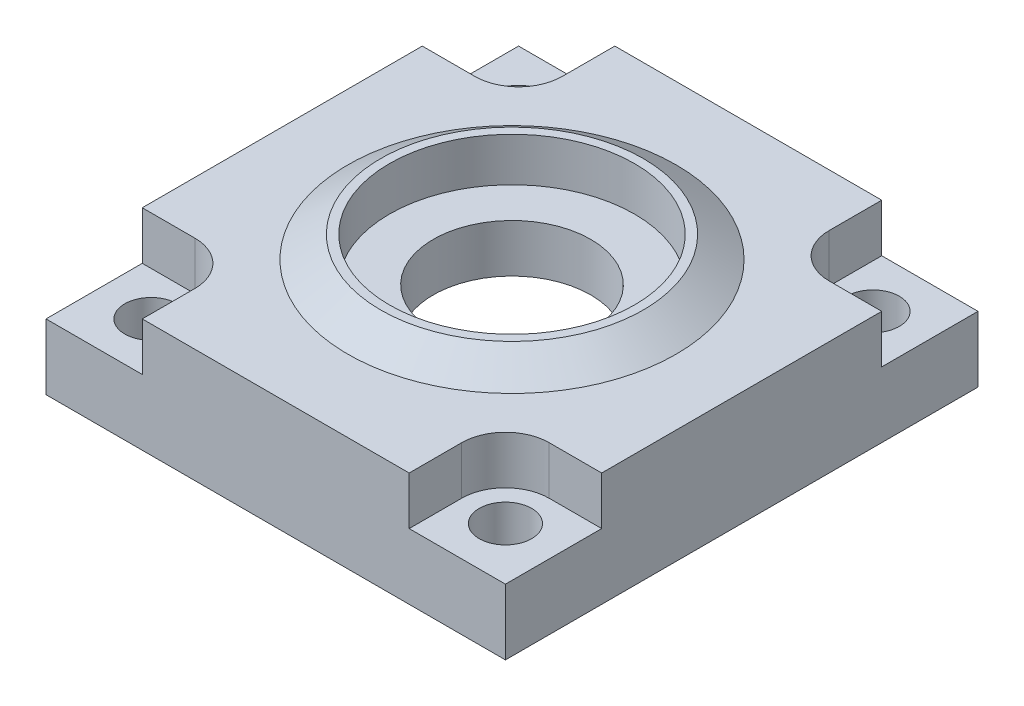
ISO-10303-21;
HEADER;
FILE_DESCRIPTION(('STEP AP214'),'2;1');
FILE_NAME('part.step','',(''),(''),'','','');
FILE_SCHEMA(('AUTOMOTIVE_DESIGN { 1 0 10303 214 1 1 1 1 }'));
ENDSEC;
DATA;
#1=APPLICATION_CONTEXT('core data for automotive mechanical design processes');
#2=APPLICATION_PROTOCOL_DEFINITION('international standard','automotive_design',2000,#1);
#3=PRODUCT_CONTEXT('',#1,'mechanical');
#4=PRODUCT('Part','Part','',(#3));
#5=PRODUCT_RELATED_PRODUCT_CATEGORY('part','',(#4));
#6=PRODUCT_DEFINITION_FORMATION('','',#4);
#7=PRODUCT_DEFINITION_CONTEXT('part definition',#1,'design');
#8=PRODUCT_DEFINITION('design','',#6,#7);
#9=PRODUCT_DEFINITION_SHAPE('','',#8);
#10=(LENGTH_UNIT() NAMED_UNIT(*) SI_UNIT(.MILLI.,.METRE.));
#11=(NAMED_UNIT(*) PLANE_ANGLE_UNIT() SI_UNIT($,.RADIAN.));
#12=(NAMED_UNIT(*) SI_UNIT($,.STERADIAN.) SOLID_ANGLE_UNIT());
#13=UNCERTAINTY_MEASURE_WITH_UNIT(LENGTH_MEASURE(1.E-05),#10,'distance_accuracy_value','');
#14=(GEOMETRIC_REPRESENTATION_CONTEXT(3) GLOBAL_UNCERTAINTY_ASSIGNED_CONTEXT((#13)) GLOBAL_UNIT_ASSIGNED_CONTEXT((#10,
#11,#12)) REPRESENTATION_CONTEXT('',''));
#15=CARTESIAN_POINT('',(0.,0.,0.));
#16=DIRECTION('',(0.,0.,1.));
#17=DIRECTION('',(1.,0.,0.));
#18=AXIS2_PLACEMENT_3D('',#15,#16,#17);
#19=CARTESIAN_POINT('',(-26.25,0.,27.));
#20=DIRECTION('',(0.,1.,0.));
#21=DIRECTION('',(0.,0.,1.));
#22=AXIS2_PLACEMENT_3D('',#19,#20,#21);
#23=PLANE('',#22);
#24=CARTESIAN_POINT('',(-20.25,0.,-21.));
#25=DIRECTION('',(0.,1.,0.));
#26=DIRECTION('',(1.,0.,0.));
#27=AXIS2_PLACEMENT_3D('',#24,#25,#26);
#28=CIRCLE('',#27,3.);
#29=CARTESIAN_POINT('',(-17.25,0.,-21.));
#30=VERTEX_POINT('',#29);
#31=EDGE_CURVE('E182',#30,#30,#28,.T.);
#32=ORIENTED_EDGE('',*,*,#31,.T.);
#33=EDGE_LOOP('',(#32));
#34=FACE_BOUND('',#33,.T.);
#35=CARTESIAN_POINT('',(20.25,0.,-21.));
#36=DIRECTION('',(0.,-1.,0.));
#37=DIRECTION('',(-1.,0.,0.));
#38=AXIS2_PLACEMENT_3D('',#35,#36,#37);
#39=CIRCLE('',#38,3.);
#40=CARTESIAN_POINT('',(17.25,0.,-21.));
#41=VERTEX_POINT('',#40);
#42=EDGE_CURVE('E608',#41,#41,#39,.T.);
#43=ORIENTED_EDGE('',*,*,#42,.F.);
#44=EDGE_LOOP('',(#43));
#45=FACE_BOUND('',#44,.T.);
#46=CARTESIAN_POINT('',(20.25,0.,21.));
#47=DIRECTION('',(0.,1.,0.));
#48=DIRECTION('',(-1.,0.,0.));
#49=AXIS2_PLACEMENT_3D('',#46,#47,#48);
#50=CIRCLE('',#49,3.);
#51=CARTESIAN_POINT('',(17.25,0.,21.));
#52=VERTEX_POINT('',#51);
#53=EDGE_CURVE('E636',#52,#52,#50,.T.);
#54=ORIENTED_EDGE('',*,*,#53,.T.);
#55=EDGE_LOOP('',(#54));
#56=FACE_BOUND('',#55,.T.);
#57=DIRECTION('',(1.,0.,0.));
#58=VECTOR('',#57,1.);
#59=CARTESIAN_POINT('',(-26.25,0.,-27.));
#60=LINE('',#59,#58);
#61=CARTESIAN_POINT('',(-26.25,0.,-27.));
#62=VERTEX_POINT('',#61);
#63=CARTESIAN_POINT('',(26.25,0.,-27.));
#64=VERTEX_POINT('',#63);
#65=EDGE_CURVE('E677',#62,#64,#60,.T.);
#66=ORIENTED_EDGE('',*,*,#65,.T.);
#67=DIRECTION('',(0.,0.,-1.));
#68=VECTOR('',#67,1.);
#69=CARTESIAN_POINT('',(26.25,0.,27.));
#70=LINE('',#69,#68);
#71=CARTESIAN_POINT('',(26.25,0.,27.));
#72=VERTEX_POINT('',#71);
#73=EDGE_CURVE('E192',#72,#64,#70,.T.);
#74=ORIENTED_EDGE('',*,*,#73,.F.);
#75=DIRECTION('',(1.,0.,0.));
#76=VECTOR('',#75,1.);
#77=CARTESIAN_POINT('',(-26.25,0.,27.));
#78=LINE('',#77,#76);
#79=CARTESIAN_POINT('',(-26.25,0.,27.));
#80=VERTEX_POINT('',#79);
#81=EDGE_CURVE('E686',#80,#72,#78,.T.);
#82=ORIENTED_EDGE('',*,*,#81,.F.);
#83=DIRECTION('',(0.,0.,-1.));
#84=VECTOR('',#83,1.);
#85=CARTESIAN_POINT('',(-26.25,0.,27.));
#86=LINE('',#85,#84);
#87=EDGE_CURVE('E201',#80,#62,#86,.T.);
#88=ORIENTED_EDGE('',*,*,#87,.T.);
#89=EDGE_LOOP('',(#66,#74,#82,#88));
#90=FACE_BOUND('',#89,.T.);
#91=CARTESIAN_POINT('',(0.,0.,0.));
#92=DIRECTION('',(0.,1.,0.));
#93=DIRECTION('',(0.,0.,1.));
#94=AXIS2_PLACEMENT_3D('',#91,#92,#93);
#95=CIRCLE('',#94,18.5);
#96=CARTESIAN_POINT('',(0.,0.,18.5));
#97=VERTEX_POINT('',#96);
#98=EDGE_CURVE('E211',#97,#97,#95,.T.);
#99=ORIENTED_EDGE('',*,*,#98,.T.);
#100=EDGE_LOOP('',(#99));
#101=FACE_BOUND('',#100,.T.);
#102=CARTESIAN_POINT('',(-20.25,0.,21.));
#103=DIRECTION('',(0.,-1.,0.));
#104=DIRECTION('',(1.,0.,0.));
#105=AXIS2_PLACEMENT_3D('',#102,#103,#104);
#106=CIRCLE('',#105,3.);
#107=CARTESIAN_POINT('',(-17.25,0.,21.));
#108=VERTEX_POINT('',#107);
#109=EDGE_CURVE('E578',#108,#108,#106,.T.);
#110=ORIENTED_EDGE('',*,*,#109,.F.);
#111=EDGE_LOOP('',(#110));
#112=FACE_BOUND('',#111,.T.);
#113=ADVANCED_FACE('F31',(#34,#45,#56,#90,#101,#112),#23,.F.);
#114=CARTESIAN_POINT('',(-26.25,7.5,27.));
#115=DIRECTION('',(0.,-1.,0.));
#116=DIRECTION('',(-1.,0.,0.));
#117=AXIS2_PLACEMENT_3D('',#114,#115,#116);
#118=PLANE('',#117);
#119=DIRECTION('',(0.,0.,1.));
#120=VECTOR('',#119,1.);
#121=CARTESIAN_POINT('',(-15.25,7.5,16.));
#122=LINE('',#121,#120);
#123=CARTESIAN_POINT('',(-15.25,7.5,21.));
#124=VERTEX_POINT('',#123);
#125=CARTESIAN_POINT('',(-15.25,7.5,27.));
#126=VERTEX_POINT('',#125);
#127=EDGE_CURVE('E596',#124,#126,#122,.T.);
#128=ORIENTED_EDGE('',*,*,#127,.F.);
#129=CARTESIAN_POINT('',(-20.25,7.5,21.));
#130=DIRECTION('',(0.,-1.,0.));
#131=DIRECTION('',(1.,0.,0.));
#132=AXIS2_PLACEMENT_3D('',#129,#130,#131);
#133=CIRCLE('',#132,5.);
#134=CARTESIAN_POINT('',(-20.25,7.5,16.));
#135=VERTEX_POINT('',#134);
#136=EDGE_CURVE('E235',#124,#135,#133,.F.);
#137=ORIENTED_EDGE('',*,*,#136,.T.);
#138=DIRECTION('',(1.,0.,0.));
#139=VECTOR('',#138,1.);
#140=CARTESIAN_POINT('',(-26.25,7.5,16.));
#141=LINE('',#140,#139);
#142=CARTESIAN_POINT('',(-26.25,7.5,16.));
#143=VERTEX_POINT('',#142);
#144=EDGE_CURVE('E598',#143,#135,#141,.T.);
#145=ORIENTED_EDGE('',*,*,#144,.F.);
#146=DIRECTION('',(0.,0.,-1.));
#147=VECTOR('',#146,1.);
#148=CARTESIAN_POINT('',(-26.25,7.5,16.));
#149=LINE('',#148,#147);
#150=CARTESIAN_POINT('',(-26.25,7.5,27.));
#151=VERTEX_POINT('',#150);
#152=EDGE_CURVE('E591',#151,#143,#149,.T.);
#153=ORIENTED_EDGE('',*,*,#152,.F.);
#154=DIRECTION('',(-1.,0.,0.));
#155=VECTOR('',#154,1.);
#156=CARTESIAN_POINT('',(-26.25,7.5,27.));
#157=LINE('',#156,#155);
#158=EDGE_CURVE('E593',#126,#151,#157,.T.);
#159=ORIENTED_EDGE('',*,*,#158,.F.);
#160=EDGE_LOOP('',(#128,#137,#145,#153,#159));
#161=FACE_BOUND('',#160,.T.);
#162=CARTESIAN_POINT('',(-20.25,7.5,21.));
#163=DIRECTION('',(0.,-1.,0.));
#164=DIRECTION('',(1.,0.,0.));
#165=AXIS2_PLACEMENT_3D('',#162,#163,#164);
#166=CIRCLE('',#165,3.);
#167=CARTESIAN_POINT('',(-17.25,7.5,21.));
#168=VERTEX_POINT('',#167);
#169=EDGE_CURVE('E581',#168,#168,#166,.T.);
#170=ORIENTED_EDGE('',*,*,#169,.T.);
#171=EDGE_LOOP('',(#170));
#172=FACE_BOUND('',#171,.T.);
#173=ADVANCED_FACE('F268',(#161,#172),#118,.F.);
#174=CARTESIAN_POINT('',(-26.25,13.,27.));
#175=DIRECTION('',(0.,-1.,0.));
#176=DIRECTION('',(1.,0.,0.));
#177=AXIS2_PLACEMENT_3D('',#174,#175,#176);
#178=PLANE('',#177);
#179=CARTESIAN_POINT('',(0.,13.,0.));
#180=DIRECTION('',(0.,-1.,0.));
#181=DIRECTION('',(1.,0.,0.));
#182=AXIS2_PLACEMENT_3D('',#179,#180,#181);
#183=CIRCLE('',#182,18.75);
#184=CARTESIAN_POINT('',(18.75,13.,0.));
#185=VERTEX_POINT('',#184);
#186=EDGE_CURVE('E204',#185,#185,#183,.F.);
#187=ORIENTED_EDGE('',*,*,#186,.F.);
#188=EDGE_LOOP('',(#187));
#189=FACE_BOUND('',#188,.T.);
#190=DIRECTION('',(-1.,0.,0.));
#191=VECTOR('',#190,1.);
#192=CARTESIAN_POINT('',(-26.25,13.,-27.));
#193=LINE('',#192,#191);
#194=CARTESIAN_POINT('',(15.25,13.,-27.));
#195=VERTEX_POINT('',#194);
#196=CARTESIAN_POINT('',(-15.25,13.,-27.));
#197=VERTEX_POINT('',#196);
#198=EDGE_CURVE('E682',#195,#197,#193,.T.);
#199=ORIENTED_EDGE('',*,*,#198,.T.);
#200=DIRECTION('',(0.,0.,-1.));
#201=VECTOR('',#200,1.);
#202=CARTESIAN_POINT('',(-15.25,13.,-16.));
#203=LINE('',#202,#201);
#204=CARTESIAN_POINT('',(-15.25,13.,-21.));
#205=VERTEX_POINT('',#204);
#206=EDGE_CURVE('E181',#205,#197,#203,.T.);
#207=ORIENTED_EDGE('',*,*,#206,.F.);
#208=CARTESIAN_POINT('',(-20.25,13.,-21.));
#209=DIRECTION('',(0.,-1.,0.));
#210=DIRECTION('',(1.,0.,0.));
#211=AXIS2_PLACEMENT_3D('',#208,#209,#210);
#212=CIRCLE('',#211,5.);
#213=CARTESIAN_POINT('',(-20.25,13.,-16.));
#214=VERTEX_POINT('',#213);
#215=EDGE_CURVE('E11',#205,#214,#212,.T.);
#216=ORIENTED_EDGE('',*,*,#215,.T.);
#217=DIRECTION('',(1.,0.,0.));
#218=VECTOR('',#217,1.);
#219=CARTESIAN_POINT('',(-26.25,13.,-16.));
#220=LINE('',#219,#218);
#221=CARTESIAN_POINT('',(-26.25,13.,-16.));
#222=VERTEX_POINT('',#221);
#223=EDGE_CURVE('E167',#222,#214,#220,.T.);
#224=ORIENTED_EDGE('',*,*,#223,.F.);
#225=DIRECTION('',(0.,0.,-1.));
#226=VECTOR('',#225,1.);
#227=CARTESIAN_POINT('',(-26.25,13.,27.));
#228=LINE('',#227,#226);
#229=CARTESIAN_POINT('',(-26.25,13.,16.));
#230=VERTEX_POINT('',#229);
#231=EDGE_CURVE('E180',#230,#222,#228,.T.);
#232=ORIENTED_EDGE('',*,*,#231,.F.);
#233=DIRECTION('',(1.,0.,0.));
#234=VECTOR('',#233,1.);
#235=CARTESIAN_POINT('',(-26.25,13.,16.));
#236=LINE('',#235,#234);
#237=CARTESIAN_POINT('',(-20.25,13.,16.));
#238=VERTEX_POINT('',#237);
#239=EDGE_CURVE('E589',#230,#238,#236,.T.);
#240=ORIENTED_EDGE('',*,*,#239,.T.);
#241=CARTESIAN_POINT('',(-20.25,13.,21.));
#242=DIRECTION('',(0.,-1.,0.));
#243=DIRECTION('',(1.,0.,0.));
#244=AXIS2_PLACEMENT_3D('',#241,#242,#243);
#245=CIRCLE('',#244,5.);
#246=CARTESIAN_POINT('',(-15.25,13.,21.));
#247=VERTEX_POINT('',#246);
#248=EDGE_CURVE('E237',#238,#247,#245,.T.);
#249=ORIENTED_EDGE('',*,*,#248,.T.);
#250=DIRECTION('',(0.,0.,1.));
#251=VECTOR('',#250,1.);
#252=CARTESIAN_POINT('',(-15.25,13.,16.));
#253=LINE('',#252,#251);
#254=CARTESIAN_POINT('',(-15.25,13.,27.));
#255=VERTEX_POINT('',#254);
#256=EDGE_CURVE('E584',#247,#255,#253,.T.);
#257=ORIENTED_EDGE('',*,*,#256,.T.);
#258=DIRECTION('',(-1.,0.,0.));
#259=VECTOR('',#258,1.);
#260=CARTESIAN_POINT('',(-26.25,13.,27.));
#261=LINE('',#260,#259);
#262=CARTESIAN_POINT('',(15.25,13.,27.));
#263=VERTEX_POINT('',#262);
#264=EDGE_CURVE('E189',#263,#255,#261,.T.);
#265=ORIENTED_EDGE('',*,*,#264,.F.);
#266=DIRECTION('',(0.,0.,1.));
#267=VECTOR('',#266,1.);
#268=CARTESIAN_POINT('',(15.25,13.,16.));
#269=LINE('',#268,#267);
#270=CARTESIAN_POINT('',(15.25,13.,21.));
#271=VERTEX_POINT('',#270);
#272=EDGE_CURVE('E642',#271,#263,#269,.T.);
#273=ORIENTED_EDGE('',*,*,#272,.F.);
#274=CARTESIAN_POINT('',(20.25,13.,21.));
#275=DIRECTION('',(0.,-1.,0.));
#276=DIRECTION('',(1.,0.,0.));
#277=AXIS2_PLACEMENT_3D('',#274,#275,#276);
#278=CIRCLE('',#277,5.);
#279=CARTESIAN_POINT('',(20.25,13.,16.));
#280=VERTEX_POINT('',#279);
#281=EDGE_CURVE('E219',#271,#280,#278,.T.);
#282=ORIENTED_EDGE('',*,*,#281,.T.);
#283=DIRECTION('',(-1.,0.,0.));
#284=VECTOR('',#283,1.);
#285=CARTESIAN_POINT('',(26.25,13.,16.));
#286=LINE('',#285,#284);
#287=CARTESIAN_POINT('',(26.25,13.,16.));
#288=VERTEX_POINT('',#287);
#289=EDGE_CURVE('E639',#288,#280,#286,.T.);
#290=ORIENTED_EDGE('',*,*,#289,.F.);
#291=DIRECTION('',(0.,0.,-1.));
#292=VECTOR('',#291,1.);
#293=CARTESIAN_POINT('',(26.25,13.,27.));
#294=LINE('',#293,#292);
#295=CARTESIAN_POINT('',(26.25,13.,-16.));
#296=VERTEX_POINT('',#295);
#297=EDGE_CURVE('E188',#288,#296,#294,.T.);
#298=ORIENTED_EDGE('',*,*,#297,.T.);
#299=DIRECTION('',(-1.,0.,0.));
#300=VECTOR('',#299,1.);
#301=CARTESIAN_POINT('',(26.25,13.,-16.));
#302=LINE('',#301,#300);
#303=CARTESIAN_POINT('',(20.25,13.,-16.));
#304=VERTEX_POINT('',#303);
#305=EDGE_CURVE('E613',#296,#304,#302,.T.);
#306=ORIENTED_EDGE('',*,*,#305,.T.);
#307=CARTESIAN_POINT('',(20.25,13.,-21.));
#308=DIRECTION('',(0.,-1.,0.));
#309=DIRECTION('',(1.,0.,0.));
#310=AXIS2_PLACEMENT_3D('',#307,#308,#309);
#311=CIRCLE('',#310,5.);
#312=CARTESIAN_POINT('',(15.25,13.,-21.));
#313=VERTEX_POINT('',#312);
#314=EDGE_CURVE('E228',#304,#313,#311,.T.);
#315=ORIENTED_EDGE('',*,*,#314,.T.);
#316=DIRECTION('',(0.,0.,-1.));
#317=VECTOR('',#316,1.);
#318=CARTESIAN_POINT('',(15.25,13.,-16.));
#319=LINE('',#318,#317);
#320=EDGE_CURVE('E611',#313,#195,#319,.T.);
#321=ORIENTED_EDGE('',*,*,#320,.T.);
#322=EDGE_LOOP('',(#199,#207,#216,#224,#232,#240,#249,#257,#265,#273,#282,#290,#298,#306,#315,#321));
#323=FACE_BOUND('',#322,.T.);
#324=ADVANCED_FACE('F178',(#189,#323),#178,.F.);
#325=CARTESIAN_POINT('',(-26.25,13.,27.));
#326=DIRECTION('',(1.,0.,0.));
#327=DIRECTION('',(0.,1.,0.));
#328=AXIS2_PLACEMENT_3D('',#325,#326,#327);
#329=PLANE('',#328);
#330=ORIENTED_EDGE('',*,*,#231,.T.);
#331=DIRECTION('',(0.,1.,0.));
#332=VECTOR('',#331,1.);
#333=CARTESIAN_POINT('',(-26.25,7.5,-16.));
#334=LINE('',#333,#332);
#335=CARTESIAN_POINT('',(-26.25,7.5,-16.));
#336=VERTEX_POINT('',#335);
#337=EDGE_CURVE('E165',#336,#222,#334,.T.);
#338=ORIENTED_EDGE('',*,*,#337,.F.);
#339=DIRECTION('',(0.,0.,1.));
#340=VECTOR('',#339,1.);
#341=CARTESIAN_POINT('',(-26.25,7.5,-16.));
#342=LINE('',#341,#340);
#343=CARTESIAN_POINT('',(-26.25,7.5,-27.));
#344=VERTEX_POINT('',#343);
#345=EDGE_CURVE('E726',#344,#336,#342,.T.);
#346=ORIENTED_EDGE('',*,*,#345,.F.);
#347=DIRECTION('',(0.,-1.,0.));
#348=VECTOR('',#347,1.);
#349=CARTESIAN_POINT('',(-26.25,13.,-27.));
#350=LINE('',#349,#348);
#351=EDGE_CURVE('E675',#344,#62,#350,.T.);
#352=ORIENTED_EDGE('',*,*,#351,.T.);
#353=ORIENTED_EDGE('',*,*,#87,.F.);
#354=DIRECTION('',(0.,-1.,0.));
#355=VECTOR('',#354,1.);
#356=CARTESIAN_POINT('',(-26.25,13.,27.));
#357=LINE('',#356,#355);
#358=EDGE_CURVE('E684',#151,#80,#357,.T.);
#359=ORIENTED_EDGE('',*,*,#358,.F.);
#360=ORIENTED_EDGE('',*,*,#152,.T.);
#361=DIRECTION('',(0.,1.,0.));
#362=VECTOR('',#361,1.);
#363=CARTESIAN_POINT('',(-26.25,7.5,16.));
#364=LINE('',#363,#362);
#365=EDGE_CURVE('E187',#143,#230,#364,.T.);
#366=ORIENTED_EDGE('',*,*,#365,.T.);
#367=EDGE_LOOP('',(#330,#338,#346,#352,#353,#359,#360,#366));
#368=FACE_BOUND('',#367,.T.);
#369=ADVANCED_FACE('F33',(#368),#329,.F.);
#370=CARTESIAN_POINT('',(-26.25,13.,27.));
#371=DIRECTION('',(0.,0.,1.));
#372=DIRECTION('',(1.,0.,0.));
#373=AXIS2_PLACEMENT_3D('',#370,#371,#372);
#374=PLANE('',#373);
#375=ORIENTED_EDGE('',*,*,#264,.T.);
#376=DIRECTION('',(0.,1.,0.));
#377=VECTOR('',#376,1.);
#378=CARTESIAN_POINT('',(-15.25,7.5,27.));
#379=LINE('',#378,#377);
#380=EDGE_CURVE('E601',#126,#255,#379,.T.);
#381=ORIENTED_EDGE('',*,*,#380,.F.);
#382=ORIENTED_EDGE('',*,*,#158,.T.);
#383=ORIENTED_EDGE('',*,*,#358,.T.);
#384=ORIENTED_EDGE('',*,*,#81,.T.);
#385=DIRECTION('',(0.,1.,0.));
#386=VECTOR('',#385,1.);
#387=CARTESIAN_POINT('',(26.25,13.,27.));
#388=LINE('',#387,#386);
#389=CARTESIAN_POINT('',(26.25,7.5,27.));
#390=VERTEX_POINT('',#389);
#391=EDGE_CURVE('E195',#72,#390,#388,.T.);
#392=ORIENTED_EDGE('',*,*,#391,.T.);
#393=DIRECTION('',(1.,0.,0.));
#394=VECTOR('',#393,1.);
#395=CARTESIAN_POINT('',(26.25,7.5,27.));
#396=LINE('',#395,#394);
#397=CARTESIAN_POINT('',(15.25,7.5,27.));
#398=VERTEX_POINT('',#397);
#399=EDGE_CURVE('E652',#398,#390,#396,.T.);
#400=ORIENTED_EDGE('',*,*,#399,.F.);
#401=DIRECTION('',(0.,1.,0.));
#402=VECTOR('',#401,1.);
#403=CARTESIAN_POINT('',(15.25,7.5,27.));
#404=LINE('',#403,#402);
#405=EDGE_CURVE('E655',#398,#263,#404,.T.);
#406=ORIENTED_EDGE('',*,*,#405,.T.);
#407=EDGE_LOOP('',(#375,#381,#382,#383,#384,#392,#400,#406));
#408=FACE_BOUND('',#407,.T.);
#409=ADVANCED_FACE('F287',(#408),#374,.T.);
#410=CARTESIAN_POINT('',(26.25,7.5,-27.));
#411=DIRECTION('',(0.,-1.,0.));
#412=DIRECTION('',(1.,0.,0.));
#413=AXIS2_PLACEMENT_3D('',#410,#411,#412);
#414=PLANE('',#413);
#415=DIRECTION('',(0.,0.,-1.));
#416=VECTOR('',#415,1.);
#417=CARTESIAN_POINT('',(15.25,7.5,-16.));
#418=LINE('',#417,#416);
#419=CARTESIAN_POINT('',(15.25,7.5,-21.));
#420=VERTEX_POINT('',#419);
#421=CARTESIAN_POINT('',(15.25,7.5,-27.));
#422=VERTEX_POINT('',#421);
#423=EDGE_CURVE('E622',#420,#422,#418,.T.);
#424=ORIENTED_EDGE('',*,*,#423,.F.);
#425=CARTESIAN_POINT('',(20.25,7.5,-21.));
#426=DIRECTION('',(0.,-1.,0.));
#427=DIRECTION('',(1.,0.,0.));
#428=AXIS2_PLACEMENT_3D('',#425,#426,#427);
#429=CIRCLE('',#428,5.);
#430=CARTESIAN_POINT('',(20.25,7.5,-16.));
#431=VERTEX_POINT('',#430);
#432=EDGE_CURVE('E226',#420,#431,#429,.F.);
#433=ORIENTED_EDGE('',*,*,#432,.T.);
#434=DIRECTION('',(-1.,0.,0.));
#435=VECTOR('',#434,1.);
#436=CARTESIAN_POINT('',(26.25,7.5,-16.));
#437=LINE('',#436,#435);
#438=CARTESIAN_POINT('',(26.25,7.5,-16.));
#439=VERTEX_POINT('',#438);
#440=EDGE_CURVE('E624',#439,#431,#437,.T.);
#441=ORIENTED_EDGE('',*,*,#440,.F.);
#442=DIRECTION('',(0.,0.,1.));
#443=VECTOR('',#442,1.);
#444=CARTESIAN_POINT('',(26.25,7.5,-16.));
#445=LINE('',#444,#443);
#446=CARTESIAN_POINT('',(26.25,7.5,-27.));
#447=VERTEX_POINT('',#446);
#448=EDGE_CURVE('E616',#447,#439,#445,.T.);
#449=ORIENTED_EDGE('',*,*,#448,.F.);
#450=DIRECTION('',(1.,0.,0.));
#451=VECTOR('',#450,1.);
#452=CARTESIAN_POINT('',(26.25,7.5,-27.));
#453=LINE('',#452,#451);
#454=EDGE_CURVE('E619',#422,#447,#453,.T.);
#455=ORIENTED_EDGE('',*,*,#454,.F.);
#456=EDGE_LOOP('',(#424,#433,#441,#449,#455));
#457=FACE_BOUND('',#456,.T.);
#458=CARTESIAN_POINT('',(20.25,7.5,-21.));
#459=DIRECTION('',(0.,-1.,0.));
#460=DIRECTION('',(-1.,0.,0.));
#461=AXIS2_PLACEMENT_3D('',#458,#459,#460);
#462=CIRCLE('',#461,3.);
#463=CARTESIAN_POINT('',(17.25,7.5,-21.));
#464=VERTEX_POINT('',#463);
#465=EDGE_CURVE('E603',#464,#464,#462,.T.);
#466=ORIENTED_EDGE('',*,*,#465,.T.);
#467=EDGE_LOOP('',(#466));
#468=FACE_BOUND('',#467,.T.);
#469=ADVANCED_FACE('F282',(#457,#468),#414,.F.);
#470=CARTESIAN_POINT('',(26.25,13.,27.));
#471=DIRECTION('',(-1.,0.,0.));
#472=DIRECTION('',(0.,-1.,0.));
#473=AXIS2_PLACEMENT_3D('',#470,#471,#472);
#474=PLANE('',#473);
#475=DIRECTION('',(0.,1.,0.));
#476=VECTOR('',#475,1.);
#477=CARTESIAN_POINT('',(26.25,7.5,-16.));
#478=LINE('',#477,#476);
#479=EDGE_CURVE('E628',#439,#296,#478,.T.);
#480=ORIENTED_EDGE('',*,*,#479,.T.);
#481=ORIENTED_EDGE('',*,*,#297,.F.);
#482=DIRECTION('',(0.,1.,0.));
#483=VECTOR('',#482,1.);
#484=CARTESIAN_POINT('',(26.25,7.5,16.));
#485=LINE('',#484,#483);
#486=CARTESIAN_POINT('',(26.25,7.5,16.));
#487=VERTEX_POINT('',#486);
#488=EDGE_CURVE('E654',#487,#288,#485,.T.);
#489=ORIENTED_EDGE('',*,*,#488,.F.);
#490=DIRECTION('',(0.,0.,-1.));
#491=VECTOR('',#490,1.);
#492=CARTESIAN_POINT('',(26.25,7.5,16.));
#493=LINE('',#492,#491);
#494=EDGE_CURVE('E644',#390,#487,#493,.T.);
#495=ORIENTED_EDGE('',*,*,#494,.F.);
#496=ORIENTED_EDGE('',*,*,#391,.F.);
#497=ORIENTED_EDGE('',*,*,#73,.T.);
#498=DIRECTION('',(0.,1.,0.));
#499=VECTOR('',#498,1.);
#500=CARTESIAN_POINT('',(26.25,13.,-27.));
#501=LINE('',#500,#499);
#502=EDGE_CURVE('E679',#64,#447,#501,.T.);
#503=ORIENTED_EDGE('',*,*,#502,.T.);
#504=ORIENTED_EDGE('',*,*,#448,.T.);
#505=EDGE_LOOP('',(#480,#481,#489,#495,#496,#497,#503,#504));
#506=FACE_BOUND('',#505,.T.);
#507=ADVANCED_FACE('F278',(#506),#474,.F.);
#508=CARTESIAN_POINT('',(-26.25,13.,-27.));
#509=DIRECTION('',(0.,0.,1.));
#510=DIRECTION('',(1.,0.,0.));
#511=AXIS2_PLACEMENT_3D('',#508,#509,#510);
#512=PLANE('',#511);
#513=DIRECTION('',(-1.,0.,0.));
#514=VECTOR('',#513,1.);
#515=CARTESIAN_POINT('',(-26.25,7.5,-27.));
#516=LINE('',#515,#514);
#517=CARTESIAN_POINT('',(-15.25,7.5,-27.));
#518=VERTEX_POINT('',#517);
#519=EDGE_CURVE('E174',#518,#344,#516,.T.);
#520=ORIENTED_EDGE('',*,*,#519,.F.);
#521=DIRECTION('',(0.,1.,0.));
#522=VECTOR('',#521,1.);
#523=CARTESIAN_POINT('',(-15.25,7.5,-27.));
#524=LINE('',#523,#522);
#525=EDGE_CURVE('E173',#518,#197,#524,.T.);
#526=ORIENTED_EDGE('',*,*,#525,.T.);
#527=ORIENTED_EDGE('',*,*,#198,.F.);
#528=DIRECTION('',(0.,1.,0.));
#529=VECTOR('',#528,1.);
#530=CARTESIAN_POINT('',(15.25,7.5,-27.));
#531=LINE('',#530,#529);
#532=EDGE_CURVE('E627',#422,#195,#531,.T.);
#533=ORIENTED_EDGE('',*,*,#532,.F.);
#534=ORIENTED_EDGE('',*,*,#454,.T.);
#535=ORIENTED_EDGE('',*,*,#502,.F.);
#536=ORIENTED_EDGE('',*,*,#65,.F.);
#537=ORIENTED_EDGE('',*,*,#351,.F.);
#538=EDGE_LOOP('',(#520,#526,#527,#533,#534,#535,#536,#537));
#539=FACE_BOUND('',#538,.T.);
#540=ADVANCED_FACE('F281',(#539),#512,.F.);
#541=CARTESIAN_POINT('',(-15.,15.5,0.));
#542=DIRECTION('',(0.,-1.,0.));
#543=DIRECTION('',(0.,0.,-1.));
#544=AXIS2_PLACEMENT_3D('',#541,#542,#543);
#545=PLANE('',#544);
#546=CARTESIAN_POINT('',(0.,15.5,0.));
#547=DIRECTION('',(0.,1.,0.));
#548=DIRECTION('',(0.,0.,1.));
#549=AXIS2_PLACEMENT_3D('',#546,#547,#548);
#550=CIRCLE('',#549,14.);
#551=CARTESIAN_POINT('',(0.,15.5,14.));
#552=VERTEX_POINT('',#551);
#553=EDGE_CURVE('E666',#552,#552,#550,.T.);
#554=ORIENTED_EDGE('',*,*,#553,.F.);
#555=EDGE_LOOP('',(#554));
#556=FACE_BOUND('',#555,.T.);
#557=CARTESIAN_POINT('',(0.,15.5,0.));
#558=DIRECTION('',(0.,-1.,0.));
#559=DIRECTION('',(0.,0.,-1.));
#560=AXIS2_PLACEMENT_3D('',#557,#558,#559);
#561=CIRCLE('',#560,15.);
#562=CARTESIAN_POINT('',(0.,15.5,-15.));
#563=VERTEX_POINT('',#562);
#564=EDGE_CURVE('E672',#563,#563,#561,.T.);
#565=ORIENTED_EDGE('',*,*,#564,.F.);
#566=EDGE_LOOP('',(#565));
#567=FACE_BOUND('',#566,.T.);
#568=ADVANCED_FACE('F293',(#556,#567),#545,.F.);
#569=CARTESIAN_POINT('',(0.,15.5,0.));
#570=DIRECTION('',(0.,-1.,0.));
#571=DIRECTION('',(0.,0.,-1.));
#572=AXIS2_PLACEMENT_3D('',#569,#570,#571);
#573=CONICAL_SURFACE('',#572,15.,0.982793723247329);
#574=ORIENTED_EDGE('',*,*,#186,.T.);
#575=EDGE_LOOP('',(#574));
#576=FACE_BOUND('',#575,.T.);
#577=ORIENTED_EDGE('',*,*,#564,.T.);
#578=EDGE_LOOP('',(#577));
#579=FACE_BOUND('',#578,.T.);
#580=ADVANCED_FACE('F297',(#576,#579),#573,.T.);
#581=CARTESIAN_POINT('',(0.,10.5,0.));
#582=DIRECTION('',(0.,1.,0.));
#583=DIRECTION('',(0.,0.,1.));
#584=AXIS2_PLACEMENT_3D('',#581,#582,#583);
#585=CYLINDRICAL_SURFACE('',#584,14.);
#586=CARTESIAN_POINT('',(0.,10.5,0.));
#587=DIRECTION('',(0.,1.,0.));
#588=DIRECTION('',(0.,0.,1.));
#589=AXIS2_PLACEMENT_3D('',#586,#587,#588);
#590=CIRCLE('',#589,14.);
#591=CARTESIAN_POINT('',(0.,10.5,14.));
#592=VERTEX_POINT('',#591);
#593=EDGE_CURVE('E669',#592,#592,#590,.T.);
#594=ORIENTED_EDGE('',*,*,#593,.F.);
#595=EDGE_LOOP('',(#594));
#596=FACE_BOUND('',#595,.T.);
#597=ORIENTED_EDGE('',*,*,#553,.T.);
#598=EDGE_LOOP('',(#597));
#599=FACE_BOUND('',#598,.T.);
#600=ADVANCED_FACE('F301',(#596,#599),#585,.F.);
#601=CARTESIAN_POINT('',(0.,10.5,0.));
#602=DIRECTION('',(0.,1.,0.));
#603=DIRECTION('',(0.,0.,1.));
#604=AXIS2_PLACEMENT_3D('',#601,#602,#603);
#605=PLANE('',#604);
#606=CARTESIAN_POINT('',(0.,10.5,0.));
#607=DIRECTION('',(0.,1.,0.));
#608=DIRECTION('',(0.,0.,1.));
#609=AXIS2_PLACEMENT_3D('',#606,#607,#608);
#610=CIRCLE('',#609,9.);
#611=CARTESIAN_POINT('',(0.,10.5,9.));
#612=VERTEX_POINT('',#611);
#613=EDGE_CURVE('E212',#612,#612,#610,.T.);
#614=ORIENTED_EDGE('',*,*,#613,.F.);
#615=EDGE_LOOP('',(#614));
#616=FACE_BOUND('',#615,.T.);
#617=ORIENTED_EDGE('',*,*,#593,.T.);
#618=EDGE_LOOP('',(#617));
#619=FACE_BOUND('',#618,.T.);
#620=ADVANCED_FACE('F305',(#616,#619),#605,.T.);
#621=CARTESIAN_POINT('',(0.,5.,0.));
#622=DIRECTION('',(0.,-1.,0.));
#623=DIRECTION('',(0.,0.,-1.));
#624=AXIS2_PLACEMENT_3D('',#621,#622,#623);
#625=CYLINDRICAL_SURFACE('',#624,18.5);
#626=CARTESIAN_POINT('',(0.,5.,0.));
#627=DIRECTION('',(0.,1.,0.));
#628=DIRECTION('',(0.,0.,1.));
#629=AXIS2_PLACEMENT_3D('',#626,#627,#628);
#630=CIRCLE('',#629,18.5);
#631=CARTESIAN_POINT('',(0.,5.,18.5));
#632=VERTEX_POINT('',#631);
#633=EDGE_CURVE('E663',#632,#632,#630,.T.);
#634=ORIENTED_EDGE('',*,*,#633,.T.);
#635=EDGE_LOOP('',(#634));
#636=FACE_BOUND('',#635,.T.);
#637=ORIENTED_EDGE('',*,*,#98,.F.);
#638=EDGE_LOOP('',(#637));
#639=FACE_BOUND('',#638,.T.);
#640=ADVANCED_FACE('F309',(#636,#639),#625,.F.);
#641=CARTESIAN_POINT('',(0.,5.,0.));
#642=DIRECTION('',(0.,1.,0.));
#643=DIRECTION('',(0.,0.,1.));
#644=AXIS2_PLACEMENT_3D('',#641,#642,#643);
#645=PLANE('',#644);
#646=CARTESIAN_POINT('',(0.,5.,0.));
#647=DIRECTION('',(0.,1.,0.));
#648=DIRECTION('',(0.,0.,1.));
#649=AXIS2_PLACEMENT_3D('',#646,#647,#648);
#650=CIRCLE('',#649,9.);
#651=CARTESIAN_POINT('',(0.,5.,9.));
#652=VERTEX_POINT('',#651);
#653=EDGE_CURVE('E208',#652,#652,#650,.T.);
#654=ORIENTED_EDGE('',*,*,#653,.T.);
#655=EDGE_LOOP('',(#654));
#656=FACE_BOUND('',#655,.T.);
#657=ORIENTED_EDGE('',*,*,#633,.F.);
#658=EDGE_LOOP('',(#657));
#659=FACE_BOUND('',#658,.T.);
#660=ADVANCED_FACE('F313',(#656,#659),#645,.F.);
#661=CARTESIAN_POINT('',(0.,0.,0.));
#662=DIRECTION('',(0.,1.,0.));
#663=DIRECTION('',(0.,0.,1.));
#664=AXIS2_PLACEMENT_3D('',#661,#662,#663);
#665=CYLINDRICAL_SURFACE('',#664,9.);
#666=ORIENTED_EDGE('',*,*,#613,.T.);
#667=EDGE_LOOP('',(#666));
#668=FACE_BOUND('',#667,.T.);
#669=ORIENTED_EDGE('',*,*,#653,.F.);
#670=EDGE_LOOP('',(#669));
#671=FACE_BOUND('',#670,.T.);
#672=ADVANCED_FACE('F317',(#668,#671),#665,.F.);
#673=CARTESIAN_POINT('',(15.25,7.5,16.));
#674=DIRECTION('',(-1.,0.,0.));
#675=DIRECTION('',(0.,-1.,0.));
#676=AXIS2_PLACEMENT_3D('',#673,#674,#675);
#677=PLANE('',#676);
#678=DIRECTION('',(0.,0.,1.));
#679=VECTOR('',#678,1.);
#680=CARTESIAN_POINT('',(15.25,7.5,16.));
#681=LINE('',#680,#679);
#682=CARTESIAN_POINT('',(15.25,7.5,21.));
#683=VERTEX_POINT('',#682);
#684=EDGE_CURVE('E650',#683,#398,#681,.T.);
#685=ORIENTED_EDGE('',*,*,#684,.F.);
#686=DIRECTION('',(0.,1.,0.));
#687=VECTOR('',#686,1.);
#688=CARTESIAN_POINT('',(15.25,13.,21.));
#689=LINE('',#688,#687);
#690=EDGE_CURVE('E207',#683,#271,#689,.T.);
#691=ORIENTED_EDGE('',*,*,#690,.T.);
#692=ORIENTED_EDGE('',*,*,#272,.T.);
#693=ORIENTED_EDGE('',*,*,#405,.F.);
#694=EDGE_LOOP('',(#685,#691,#692,#693));
#695=FACE_BOUND('',#694,.T.);
#696=ADVANCED_FACE('F321',(#695),#677,.F.);
#697=CARTESIAN_POINT('',(26.25,7.5,16.));
#698=DIRECTION('',(0.,0.,-1.));
#699=DIRECTION('',(-1.,0.,0.));
#700=AXIS2_PLACEMENT_3D('',#697,#698,#699);
#701=PLANE('',#700);
#702=ORIENTED_EDGE('',*,*,#289,.T.);
#703=DIRECTION('',(0.,1.,0.));
#704=VECTOR('',#703,1.);
#705=CARTESIAN_POINT('',(20.25,7.5,16.));
#706=LINE('',#705,#704);
#707=CARTESIAN_POINT('',(20.25,7.5,16.));
#708=VERTEX_POINT('',#707);
#709=EDGE_CURVE('E215',#280,#708,#706,.F.);
#710=ORIENTED_EDGE('',*,*,#709,.T.);
#711=DIRECTION('',(-1.,0.,0.));
#712=VECTOR('',#711,1.);
#713=CARTESIAN_POINT('',(26.25,7.5,16.));
#714=LINE('',#713,#712);
#715=EDGE_CURVE('E647',#487,#708,#714,.T.);
#716=ORIENTED_EDGE('',*,*,#715,.F.);
#717=ORIENTED_EDGE('',*,*,#488,.T.);
#718=EDGE_LOOP('',(#702,#710,#716,#717));
#719=FACE_BOUND('',#718,.T.);
#720=ADVANCED_FACE('F323',(#719),#701,.F.);
#721=CARTESIAN_POINT('',(26.25,7.5,27.));
#722=DIRECTION('',(0.,-1.,0.));
#723=DIRECTION('',(1.,0.,0.));
#724=AXIS2_PLACEMENT_3D('',#721,#722,#723);
#725=PLANE('',#724);
#726=CARTESIAN_POINT('',(20.25,7.5,21.));
#727=DIRECTION('',(0.,1.,0.));
#728=DIRECTION('',(-1.,0.,0.));
#729=AXIS2_PLACEMENT_3D('',#726,#727,#728);
#730=CIRCLE('',#729,3.);
#731=CARTESIAN_POINT('',(17.25,7.5,21.));
#732=VERTEX_POINT('',#731);
#733=EDGE_CURVE('E631',#732,#732,#730,.T.);
#734=ORIENTED_EDGE('',*,*,#733,.F.);
#735=EDGE_LOOP('',(#734));
#736=FACE_BOUND('',#735,.T.);
#737=ORIENTED_EDGE('',*,*,#715,.T.);
#738=CARTESIAN_POINT('',(20.25,7.5,21.));
#739=DIRECTION('',(0.,-1.,0.));
#740=DIRECTION('',(1.,0.,0.));
#741=AXIS2_PLACEMENT_3D('',#738,#739,#740);
#742=CIRCLE('',#741,5.);
#743=EDGE_CURVE('E217',#708,#683,#742,.F.);
#744=ORIENTED_EDGE('',*,*,#743,.T.);
#745=ORIENTED_EDGE('',*,*,#684,.T.);
#746=ORIENTED_EDGE('',*,*,#399,.T.);
#747=ORIENTED_EDGE('',*,*,#494,.T.);
#748=EDGE_LOOP('',(#737,#744,#745,#746,#747));
#749=FACE_BOUND('',#748,.T.);
#750=ADVANCED_FACE('F326',(#736,#749),#725,.F.);
#751=CARTESIAN_POINT('',(20.25,7.5,21.));
#752=DIRECTION('',(0.,-1.,0.));
#753=DIRECTION('',(1.,0.,0.));
#754=AXIS2_PLACEMENT_3D('',#751,#752,#753);
#755=CYLINDRICAL_SURFACE('',#754,5.);
#756=ORIENTED_EDGE('',*,*,#743,.F.);
#757=ORIENTED_EDGE('',*,*,#709,.F.);
#758=ORIENTED_EDGE('',*,*,#281,.F.);
#759=ORIENTED_EDGE('',*,*,#690,.F.);
#760=EDGE_LOOP('',(#756,#757,#758,#759));
#761=FACE_BOUND('',#760,.T.);
#762=ADVANCED_FACE('F333',(#761),#755,.F.);
#763=CARTESIAN_POINT('',(20.25,0.,21.));
#764=DIRECTION('',(0.,1.,0.));
#765=DIRECTION('',(-1.,0.,0.));
#766=AXIS2_PLACEMENT_3D('',#763,#764,#765);
#767=CYLINDRICAL_SURFACE('',#766,3.);
#768=ORIENTED_EDGE('',*,*,#53,.F.);
#769=EDGE_LOOP('',(#768));
#770=FACE_BOUND('',#769,.T.);
#771=ORIENTED_EDGE('',*,*,#733,.T.);
#772=EDGE_LOOP('',(#771));
#773=FACE_BOUND('',#772,.T.);
#774=ADVANCED_FACE('F337',(#770,#773),#767,.F.);
#775=CARTESIAN_POINT('',(26.25,7.5,-16.));
#776=DIRECTION('',(0.,0.,-1.));
#777=DIRECTION('',(-1.,0.,0.));
#778=AXIS2_PLACEMENT_3D('',#775,#776,#777);
#779=PLANE('',#778);
#780=ORIENTED_EDGE('',*,*,#440,.T.);
#781=DIRECTION('',(0.,1.,0.));
#782=VECTOR('',#781,1.);
#783=CARTESIAN_POINT('',(20.25,13.,-16.));
#784=LINE('',#783,#782);
#785=EDGE_CURVE('E221',#431,#304,#784,.T.);
#786=ORIENTED_EDGE('',*,*,#785,.T.);
#787=ORIENTED_EDGE('',*,*,#305,.F.);
#788=ORIENTED_EDGE('',*,*,#479,.F.);
#789=EDGE_LOOP('',(#780,#786,#787,#788));
#790=FACE_BOUND('',#789,.T.);
#791=ADVANCED_FACE('F341',(#790),#779,.T.);
#792=CARTESIAN_POINT('',(15.25,7.5,-16.));
#793=DIRECTION('',(1.,0.,0.));
#794=DIRECTION('',(0.,1.,0.));
#795=AXIS2_PLACEMENT_3D('',#792,#793,#794);
#796=PLANE('',#795);
#797=ORIENTED_EDGE('',*,*,#320,.F.);
#798=DIRECTION('',(0.,1.,0.));
#799=VECTOR('',#798,1.);
#800=CARTESIAN_POINT('',(15.25,7.5,-21.));
#801=LINE('',#800,#799);
#802=EDGE_CURVE('E224',#313,#420,#801,.F.);
#803=ORIENTED_EDGE('',*,*,#802,.T.);
#804=ORIENTED_EDGE('',*,*,#423,.T.);
#805=ORIENTED_EDGE('',*,*,#532,.T.);
#806=EDGE_LOOP('',(#797,#803,#804,#805));
#807=FACE_BOUND('',#806,.T.);
#808=ADVANCED_FACE('F343',(#807),#796,.T.);
#809=CARTESIAN_POINT('',(20.25,7.5,-21.));
#810=DIRECTION('',(0.,-1.,0.));
#811=DIRECTION('',(1.,0.,0.));
#812=AXIS2_PLACEMENT_3D('',#809,#810,#811);
#813=CYLINDRICAL_SURFACE('',#812,5.);
#814=ORIENTED_EDGE('',*,*,#432,.F.);
#815=ORIENTED_EDGE('',*,*,#802,.F.);
#816=ORIENTED_EDGE('',*,*,#314,.F.);
#817=ORIENTED_EDGE('',*,*,#785,.F.);
#818=EDGE_LOOP('',(#814,#815,#816,#817));
#819=FACE_BOUND('',#818,.T.);
#820=ADVANCED_FACE('F346',(#819),#813,.F.);
#821=CARTESIAN_POINT('',(20.25,0.,-21.));
#822=DIRECTION('',(0.,1.,0.));
#823=DIRECTION('',(-1.,0.,0.));
#824=AXIS2_PLACEMENT_3D('',#821,#822,#823);
#825=CYLINDRICAL_SURFACE('',#824,3.);
#826=ORIENTED_EDGE('',*,*,#42,.T.);
#827=EDGE_LOOP('',(#826));
#828=FACE_BOUND('',#827,.T.);
#829=ORIENTED_EDGE('',*,*,#465,.F.);
#830=EDGE_LOOP('',(#829));
#831=FACE_BOUND('',#830,.T.);
#832=ADVANCED_FACE('F356',(#828,#831),#825,.F.);
#833=CARTESIAN_POINT('',(-26.25,7.5,16.));
#834=DIRECTION('',(0.,0.,1.));
#835=DIRECTION('',(1.,0.,0.));
#836=AXIS2_PLACEMENT_3D('',#833,#834,#835);
#837=PLANE('',#836);
#838=ORIENTED_EDGE('',*,*,#144,.T.);
#839=DIRECTION('',(0.,1.,0.));
#840=VECTOR('',#839,1.);
#841=CARTESIAN_POINT('',(-20.25,13.,16.));
#842=LINE('',#841,#840);
#843=EDGE_CURVE('E230',#135,#238,#842,.T.);
#844=ORIENTED_EDGE('',*,*,#843,.T.);
#845=ORIENTED_EDGE('',*,*,#239,.F.);
#846=ORIENTED_EDGE('',*,*,#365,.F.);
#847=EDGE_LOOP('',(#838,#844,#845,#846));
#848=FACE_BOUND('',#847,.T.);
#849=ADVANCED_FACE('F360',(#848),#837,.T.);
#850=CARTESIAN_POINT('',(-15.25,7.5,16.));
#851=DIRECTION('',(-1.,0.,0.));
#852=DIRECTION('',(0.,-1.,0.));
#853=AXIS2_PLACEMENT_3D('',#850,#851,#852);
#854=PLANE('',#853);
#855=ORIENTED_EDGE('',*,*,#256,.F.);
#856=DIRECTION('',(0.,1.,0.));
#857=VECTOR('',#856,1.);
#858=CARTESIAN_POINT('',(-15.25,7.5,21.));
#859=LINE('',#858,#857);
#860=EDGE_CURVE('E233',#247,#124,#859,.F.);
#861=ORIENTED_EDGE('',*,*,#860,.T.);
#862=ORIENTED_EDGE('',*,*,#127,.T.);
#863=ORIENTED_EDGE('',*,*,#380,.T.);
#864=EDGE_LOOP('',(#855,#861,#862,#863));
#865=FACE_BOUND('',#864,.T.);
#866=ADVANCED_FACE('F362',(#865),#854,.T.);
#867=CARTESIAN_POINT('',(-20.25,7.5,21.));
#868=DIRECTION('',(0.,-1.,0.));
#869=DIRECTION('',(1.,0.,0.));
#870=AXIS2_PLACEMENT_3D('',#867,#868,#869);
#871=CYLINDRICAL_SURFACE('',#870,5.);
#872=ORIENTED_EDGE('',*,*,#136,.F.);
#873=ORIENTED_EDGE('',*,*,#860,.F.);
#874=ORIENTED_EDGE('',*,*,#248,.F.);
#875=ORIENTED_EDGE('',*,*,#843,.F.);
#876=EDGE_LOOP('',(#872,#873,#874,#875));
#877=FACE_BOUND('',#876,.T.);
#878=ADVANCED_FACE('F365',(#877),#871,.F.);
#879=CARTESIAN_POINT('',(-20.25,0.,21.));
#880=DIRECTION('',(0.,1.,0.));
#881=DIRECTION('',(-1.,0.,0.));
#882=AXIS2_PLACEMENT_3D('',#879,#880,#881);
#883=CYLINDRICAL_SURFACE('',#882,3.);
#884=ORIENTED_EDGE('',*,*,#109,.T.);
#885=EDGE_LOOP('',(#884));
#886=FACE_BOUND('',#885,.T.);
#887=ORIENTED_EDGE('',*,*,#169,.F.);
#888=EDGE_LOOP('',(#887));
#889=FACE_BOUND('',#888,.T.);
#890=ADVANCED_FACE('F372',(#886,#889),#883,.F.);
#891=CARTESIAN_POINT('',(-15.25,7.5,-16.));
#892=DIRECTION('',(1.,0.,0.));
#893=DIRECTION('',(0.,1.,0.));
#894=AXIS2_PLACEMENT_3D('',#891,#892,#893);
#895=PLANE('',#894);
#896=DIRECTION('',(0.,0.,-1.));
#897=VECTOR('',#896,1.);
#898=CARTESIAN_POINT('',(-15.25,7.5,-16.));
#899=LINE('',#898,#897);
#900=CARTESIAN_POINT('',(-15.25,7.5,-21.));
#901=VERTEX_POINT('',#900);
#902=EDGE_CURVE('E246',#901,#518,#899,.T.);
#903=ORIENTED_EDGE('',*,*,#902,.F.);
#904=DIRECTION('',(0.,1.,0.));
#905=VECTOR('',#904,1.);
#906=CARTESIAN_POINT('',(-15.25,13.,-21.));
#907=LINE('',#906,#905);
#908=EDGE_CURVE('E239',#901,#205,#907,.T.);
#909=ORIENTED_EDGE('',*,*,#908,.T.);
#910=ORIENTED_EDGE('',*,*,#206,.T.);
#911=ORIENTED_EDGE('',*,*,#525,.F.);
#912=EDGE_LOOP('',(#903,#909,#910,#911));
#913=FACE_BOUND('',#912,.T.);
#914=ADVANCED_FACE('F251',(#913),#895,.F.);
#915=CARTESIAN_POINT('',(-26.25,7.5,-16.));
#916=DIRECTION('',(0.,0.,1.));
#917=DIRECTION('',(1.,0.,0.));
#918=AXIS2_PLACEMENT_3D('',#915,#916,#917);
#919=PLANE('',#918);
#920=ORIENTED_EDGE('',*,*,#223,.T.);
#921=DIRECTION('',(0.,1.,0.));
#922=VECTOR('',#921,1.);
#923=CARTESIAN_POINT('',(-20.25,7.5,-16.));
#924=LINE('',#923,#922);
#925=CARTESIAN_POINT('',(-20.25,7.5,-16.));
#926=VERTEX_POINT('',#925);
#927=EDGE_CURVE('E46',#214,#926,#924,.F.);
#928=ORIENTED_EDGE('',*,*,#927,.T.);
#929=DIRECTION('',(1.,0.,0.));
#930=VECTOR('',#929,1.);
#931=CARTESIAN_POINT('',(-26.25,7.5,-16.));
#932=LINE('',#931,#930);
#933=EDGE_CURVE('E168',#336,#926,#932,.T.);
#934=ORIENTED_EDGE('',*,*,#933,.F.);
#935=ORIENTED_EDGE('',*,*,#337,.T.);
#936=EDGE_LOOP('',(#920,#928,#934,#935));
#937=FACE_BOUND('',#936,.T.);
#938=ADVANCED_FACE('F166',(#937),#919,.F.);
#939=CARTESIAN_POINT('',(-26.25,7.5,-27.));
#940=DIRECTION('',(0.,-1.,0.));
#941=DIRECTION('',(-1.,0.,0.));
#942=AXIS2_PLACEMENT_3D('',#939,#940,#941);
#943=PLANE('',#942);
#944=CARTESIAN_POINT('',(-20.25,7.5,-21.));
#945=DIRECTION('',(0.,1.,0.));
#946=DIRECTION('',(1.,0.,0.));
#947=AXIS2_PLACEMENT_3D('',#944,#945,#946);
#948=CIRCLE('',#947,3.);
#949=CARTESIAN_POINT('',(-17.25,7.5,-21.));
#950=VERTEX_POINT('',#949);
#951=EDGE_CURVE('E733',#950,#950,#948,.T.);
#952=ORIENTED_EDGE('',*,*,#951,.F.);
#953=EDGE_LOOP('',(#952));
#954=FACE_BOUND('',#953,.T.);
#955=ORIENTED_EDGE('',*,*,#933,.T.);
#956=CARTESIAN_POINT('',(-20.25,7.5,-21.));
#957=DIRECTION('',(0.,-1.,0.));
#958=DIRECTION('',(1.,0.,0.));
#959=AXIS2_PLACEMENT_3D('',#956,#957,#958);
#960=CIRCLE('',#959,5.);
#961=EDGE_CURVE('E39',#926,#901,#960,.F.);
#962=ORIENTED_EDGE('',*,*,#961,.T.);
#963=ORIENTED_EDGE('',*,*,#902,.T.);
#964=ORIENTED_EDGE('',*,*,#519,.T.);
#965=ORIENTED_EDGE('',*,*,#345,.T.);
#966=EDGE_LOOP('',(#955,#962,#963,#964,#965));
#967=FACE_BOUND('',#966,.T.);
#968=ADVANCED_FACE('F245',(#954,#967),#943,.F.);
#969=CARTESIAN_POINT('',(-20.25,7.5,-21.));
#970=DIRECTION('',(0.,-1.,0.));
#971=DIRECTION('',(1.,0.,0.));
#972=AXIS2_PLACEMENT_3D('',#969,#970,#971);
#973=CYLINDRICAL_SURFACE('',#972,5.);
#974=ORIENTED_EDGE('',*,*,#961,.F.);
#975=ORIENTED_EDGE('',*,*,#927,.F.);
#976=ORIENTED_EDGE('',*,*,#215,.F.);
#977=ORIENTED_EDGE('',*,*,#908,.F.);
#978=EDGE_LOOP('',(#974,#975,#976,#977));
#979=FACE_BOUND('',#978,.T.);
#980=ADVANCED_FACE('F255',(#979),#973,.F.);
#981=CARTESIAN_POINT('',(-20.25,0.,-21.));
#982=DIRECTION('',(0.,1.,0.));
#983=DIRECTION('',(-1.,0.,0.));
#984=AXIS2_PLACEMENT_3D('',#981,#982,#983);
#985=CYLINDRICAL_SURFACE('',#984,3.);
#986=ORIENTED_EDGE('',*,*,#31,.F.);
#987=EDGE_LOOP('',(#986));
#988=FACE_BOUND('',#987,.T.);
#989=ORIENTED_EDGE('',*,*,#951,.T.);
#990=EDGE_LOOP('',(#989));
#991=FACE_BOUND('',#990,.T.);
#992=ADVANCED_FACE('F257',(#988,#991),#985,.F.);
#993=CLOSED_SHELL('',(#113,#173,#324,#369,#409,#469,#507,#540,#568,#580,#600,#620,#640,#660,
#672,#696,#720,#750,#762,#774,#791,#808,#820,#832,#849,#866,#878,#890,#914,#938,#968,#980,#992));
#994=MANIFOLD_SOLID_BREP('B2',#993);
#995=ADVANCED_BREP_SHAPE_REPRESENTATION('',(#18,#994),#14);
#996=SHAPE_DEFINITION_REPRESENTATION(#9,#995);
ENDSEC;
END-ISO-10303-21;
